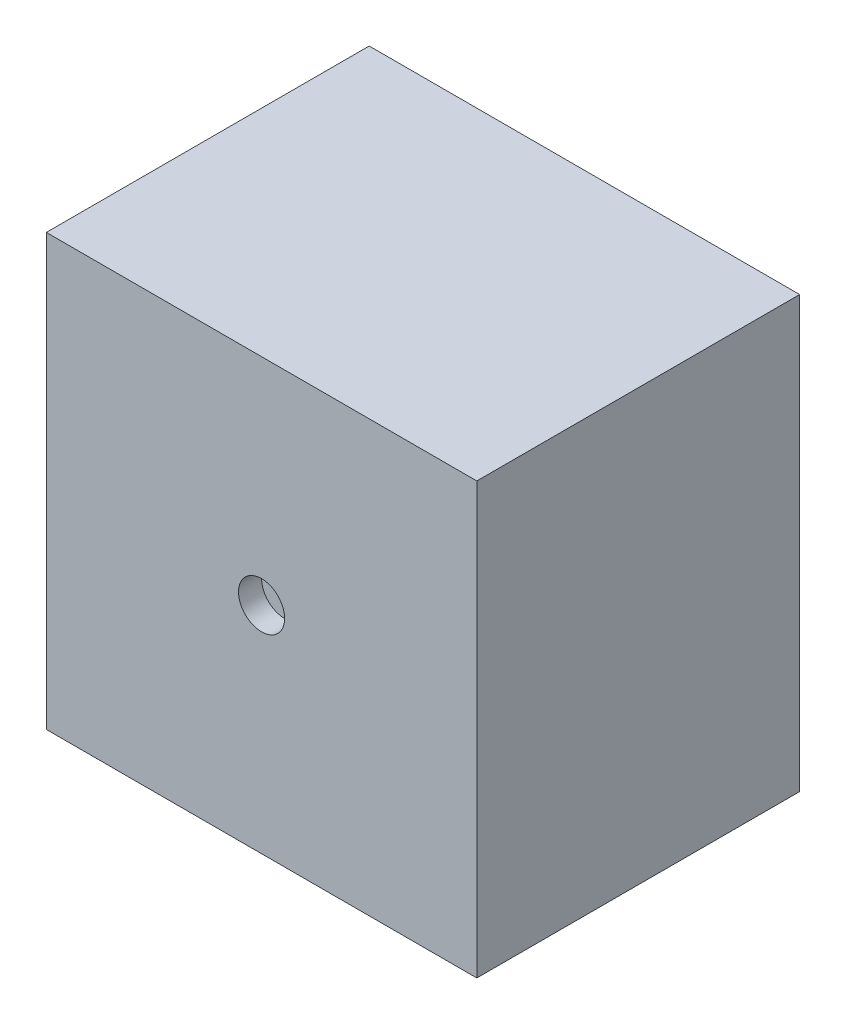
from build123d import *

# Parameters (mm, degrees)
SKETCH3_W           = 56
SKETCH3_H           = 56
BOSS_EXTRUDE1_DEPTH = 42
SKETCH4_R           = 3
CUT_EXTRUDE1_DEPTH  = 3


with BuildPart() as part:
    # Sketch3 → Boss-Extrude1 (new body)
    with BuildSketch(Plane.XY):
        with Locations((-28, 28)):
            Rectangle(SKETCH3_W, SKETCH3_H)
    extrude(amount=BOSS_EXTRUDE1_DEPTH)

    # Sketch4 → Cut-Extrude1 (cut)
    with BuildSketch(Plane.XY.offset(42)):
        with Locations((-28, 28)):
            Circle(SKETCH4_R)
    extrude(amount=-CUT_EXTRUDE1_DEPTH, mode=Mode.SUBTRACT)


solid = part.part
